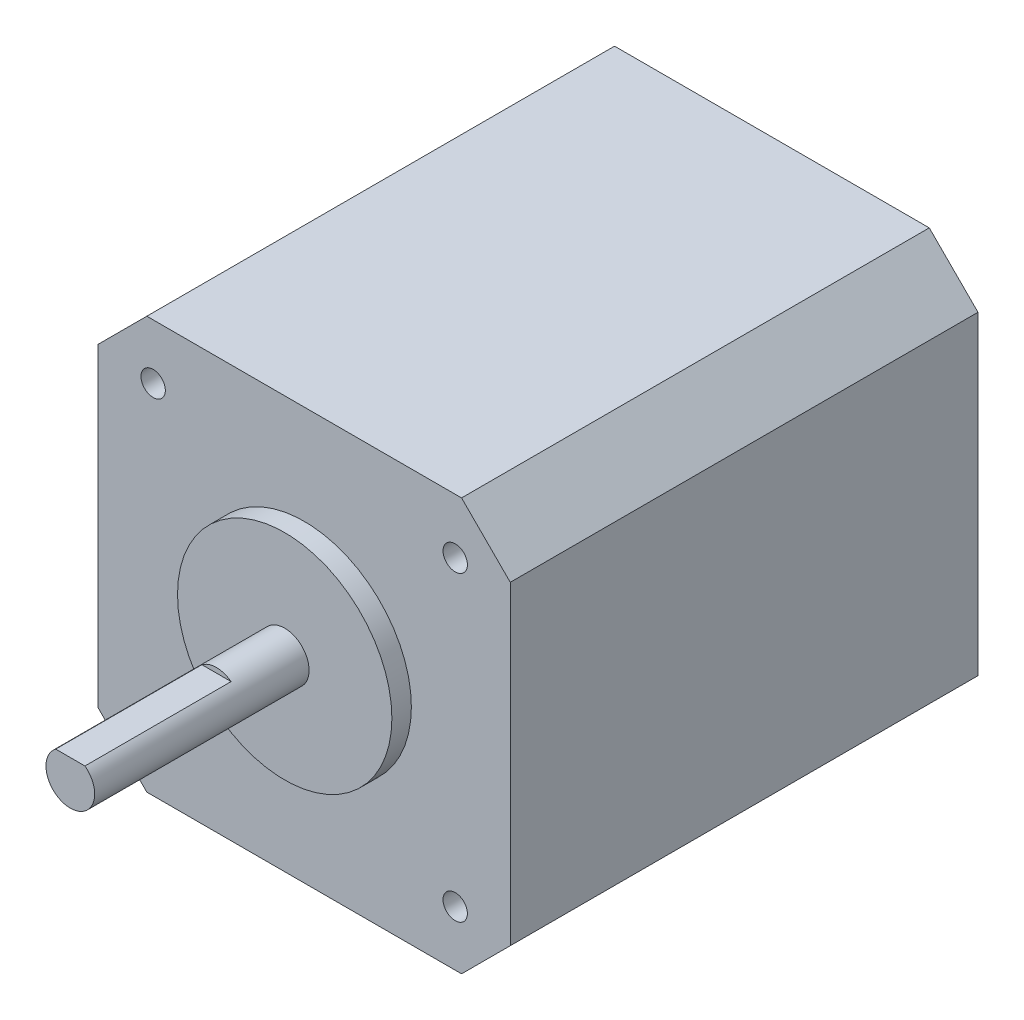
from build123d import *

# Parameters (mm, degrees)
SKETCH2_W             = 42.3
SKETCH2_H             = 42.3
BOSS_EXTRUDE1_DEPTH   = 24
M3_TAPPED_HOLE1_D     = 2.5
M3_TAPPED_HOLE1_DEPTH = 4.5
M3_TAPPED_HOLE1_TIP   = 0.751075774
CHAMFER1_SIZE         = 5
SKETCH7_R             = 11
BOSS_EXTRUDE2_DEPTH   = 2
SKETCH8_R             = 2.5
BOSS_EXTRUDE3_DEPTH   = 22
CUT_EXTRUDE1_START    = -15
CUT_EXTRUDE1_DEPTH    = 15


with BuildPart() as part:
    # Sketch2 → Boss-Extrude1 (new, symmetric)
    with BuildSketch(Plane.XY):
        Rectangle(SKETCH2_W, SKETCH2_H)
    extrude(amount=BOSS_EXTRUDE1_DEPTH, both=True)

    # M3 Tapped Hole1
    with Locations(Plane(origin=(-15.5, 15.5, 24), x_dir=(1, 0, 0), z_dir=(0, 0, 1))):
        with Locations((0, 0), (31, 0), (31, -31), (0, -31)):
            Hole(M3_TAPPED_HOLE1_D / 2, depth=M3_TAPPED_HOLE1_DEPTH)
            with Locations((0, 0, -(M3_TAPPED_HOLE1_DEPTH + M3_TAPPED_HOLE1_TIP / 2))):  # 118° drill point
                Cone(0, M3_TAPPED_HOLE1_D / 2, M3_TAPPED_HOLE1_TIP, mode=Mode.SUBTRACT)

    # Chamfer1
    chamfer1_edges = [part.edges().sort_by_distance(p)[0] for p in [
        (21.15, -21.15, 0),
        (-21.15, -21.15, 0),
        (-21.15, 21.15, 0),
        (21.15, 21.15, 0),
    ]]
    chamfer(chamfer1_edges, length=CHAMFER1_SIZE)

    # Sketch7 → Boss-Extrude2 (add)
    with BuildSketch(Plane.XY.offset(24)):
        with Locations(Location((0, 0, 0), (0, 0, 180))):
            Circle(SKETCH7_R)
    extrude(amount=BOSS_EXTRUDE2_DEPTH)

    # Sketch8 → Boss-Extrude3 (add)
    with BuildSketch(Plane.XY.offset(26)):
        Circle(SKETCH8_R)
    extrude(amount=BOSS_EXTRUDE3_DEPTH)

    # Sketch9 → Cut-Extrude1 (cut)
    with BuildSketch(Plane.XY.offset(48).offset(CUT_EXTRUDE1_START)):
        with BuildLine():
            Line((-1.5, 2), (1.5, 2))
            ThreePointArc((1.5, 2), (0, 2.5), (-1.5, 2))
        make_face()
    extrude(amount=CUT_EXTRUDE1_DEPTH, mode=Mode.SUBTRACT)


solid = part.part
